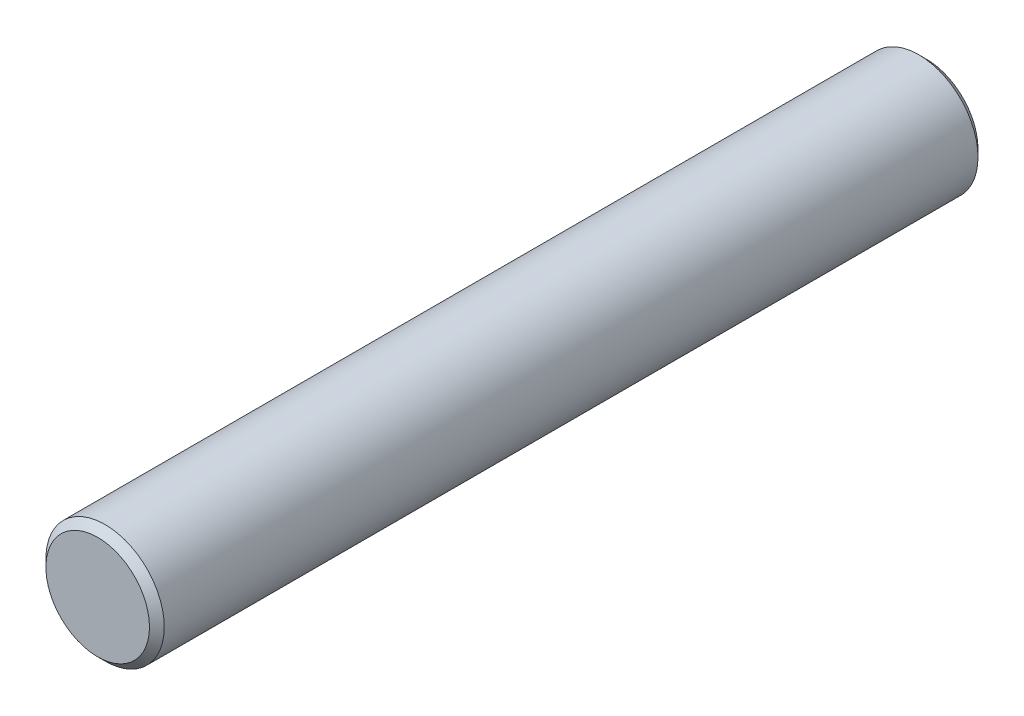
from build123d import *

# Parameters (mm, degrees)
ESQUISSE1_R         = 2
CYLINDRE_DEPTH      = 28
CHANFREIN_0_25_SIZE = 0.25


with BuildPart() as part:
    # Esquisse1 → cylindre (new body)
    with BuildSketch(Plane.XY):
        Circle(ESQUISSE1_R)
    extrude(amount=CYLINDRE_DEPTH)

    # Chanfrein 0.25
    chanfrein_0_25_edges = [part.edges().sort_by_distance(p)[0] for p in [
        (-2, 0, 0),
        (-2, 0, 28),
    ]]
    chamfer(chanfrein_0_25_edges, length=CHANFREIN_0_25_SIZE)


solid = part.part
